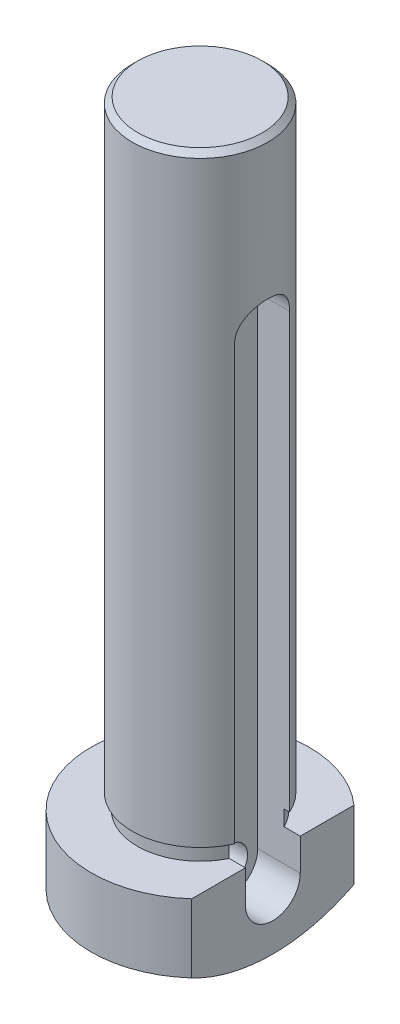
ISO-10303-21;
HEADER;
FILE_DESCRIPTION(('STEP AP214'),'2;1');
FILE_NAME('part.step','',(''),(''),'','','');
FILE_SCHEMA(('AUTOMOTIVE_DESIGN { 1 0 10303 214 1 1 1 1 }'));
ENDSEC;
DATA;
#1=APPLICATION_CONTEXT('core data for automotive mechanical design processes');
#2=APPLICATION_PROTOCOL_DEFINITION('international standard','automotive_design',2000,#1);
#3=PRODUCT_CONTEXT('',#1,'mechanical');
#4=PRODUCT('Part','Part','',(#3));
#5=PRODUCT_RELATED_PRODUCT_CATEGORY('part','',(#4));
#6=PRODUCT_DEFINITION_FORMATION('','',#4);
#7=PRODUCT_DEFINITION_CONTEXT('part definition',#1,'design');
#8=PRODUCT_DEFINITION('design','',#6,#7);
#9=PRODUCT_DEFINITION_SHAPE('','',#8);
#10=(LENGTH_UNIT() NAMED_UNIT(*) SI_UNIT(.MILLI.,.METRE.));
#11=(NAMED_UNIT(*) PLANE_ANGLE_UNIT() SI_UNIT($,.RADIAN.));
#12=(NAMED_UNIT(*) SI_UNIT($,.STERADIAN.) SOLID_ANGLE_UNIT());
#13=UNCERTAINTY_MEASURE_WITH_UNIT(LENGTH_MEASURE(1.E-05),#10,'distance_accuracy_value','');
#14=(GEOMETRIC_REPRESENTATION_CONTEXT(3) GLOBAL_UNCERTAINTY_ASSIGNED_CONTEXT((#13)) GLOBAL_UNIT_ASSIGNED_CONTEXT((#10,
#11,#12)) REPRESENTATION_CONTEXT('',''));
#15=CARTESIAN_POINT('',(0.,0.,0.));
#16=DIRECTION('',(0.,0.,1.));
#17=DIRECTION('',(1.,0.,0.));
#18=AXIS2_PLACEMENT_3D('',#15,#16,#17);
#19=CARTESIAN_POINT('',(0.,0.,0.));
#20=DIRECTION('',(0.,1.,0.));
#21=DIRECTION('',(0.,0.,1.));
#22=AXIS2_PLACEMENT_3D('',#19,#20,#21);
#23=CYLINDRICAL_SURFACE('',#22,5.0419);
#24=CARTESIAN_POINT('',(0.,1.5875,0.));
#25=DIRECTION('',(0.,1.,0.));
#26=DIRECTION('',(0.,0.,1.));
#27=AXIS2_PLACEMENT_3D('',#24,#25,#26);
#28=CIRCLE('',#27,5.0419);
#29=CARTESIAN_POINT('',(3.3655,1.5875,-3.75421967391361));
#30=VERTEX_POINT('',#29);
#31=CARTESIAN_POINT('',(3.3655,1.5875,3.75421967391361));
#32=VERTEX_POINT('',#31);
#33=EDGE_CURVE('E163',#30,#32,#28,.T.);
#34=ORIENTED_EDGE('',*,*,#33,.T.);
#35=DIRECTION('',(0.,1.,0.));
#36=VECTOR('',#35,1.);
#37=CARTESIAN_POINT('',(3.3655,0.,3.75421967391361));
#38=LINE('',#37,#36);
#39=CARTESIAN_POINT('',(3.3655,4.7625,3.75421967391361));
#40=VERTEX_POINT('',#39);
#41=EDGE_CURVE('E233',#32,#40,#38,.T.);
#42=ORIENTED_EDGE('',*,*,#41,.T.);
#43=CARTESIAN_POINT('',(0.,4.7625,0.));
#44=DIRECTION('',(0.,1.,0.));
#45=DIRECTION('',(0.,0.,1.));
#46=AXIS2_PLACEMENT_3D('',#43,#44,#45);
#47=CIRCLE('',#46,5.0419);
#48=CARTESIAN_POINT('',(3.3655,4.7625,-3.75421967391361));
#49=VERTEX_POINT('',#48);
#50=EDGE_CURVE('E160',#49,#40,#47,.T.);
#51=ORIENTED_EDGE('',*,*,#50,.F.);
#52=DIRECTION('',(0.,1.,0.));
#53=VECTOR('',#52,1.);
#54=CARTESIAN_POINT('',(3.3655,0.,-3.75421967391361));
#55=LINE('',#54,#53);
#56=EDGE_CURVE('E247',#49,#30,#55,.F.);
#57=ORIENTED_EDGE('',*,*,#56,.T.);
#58=EDGE_LOOP('',(#34,#42,#51,#57));
#59=FACE_BOUND('',#58,.T.);
#60=ADVANCED_FACE('F35',(#59),#23,.T.);
#61=CARTESIAN_POINT('',(5.0419,4.7625,0.));
#62=DIRECTION('',(0.,-1.,0.));
#63=DIRECTION('',(0.,0.,-1.));
#64=AXIS2_PLACEMENT_3D('',#61,#62,#63);
#65=PLANE('',#64);
#66=ORIENTED_EDGE('',*,*,#50,.T.);
#67=DIRECTION('',(0.,0.,-1.));
#68=VECTOR('',#67,1.);
#69=CARTESIAN_POINT('',(3.3655,4.7625,0.));
#70=LINE('',#69,#68);
#71=CARTESIAN_POINT('',(3.3655,4.7625,1.27));
#72=VERTEX_POINT('',#71);
#73=EDGE_CURVE('E238',#40,#72,#70,.T.);
#74=ORIENTED_EDGE('',*,*,#73,.T.);
#75=DIRECTION('',(1.,0.,0.));
#76=VECTOR('',#75,1.);
#77=CARTESIAN_POINT('',(5.0419,4.7625,1.27));
#78=LINE('',#77,#76);
#79=CARTESIAN_POINT('',(2.6163541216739,4.7625,1.27));
#80=VERTEX_POINT('',#79);
#81=EDGE_CURVE('E148',#80,#72,#78,.T.);
#82=ORIENTED_EDGE('',*,*,#81,.F.);
#83=CARTESIAN_POINT('',(0.,4.7625,0.));
#84=DIRECTION('',(0.,1.,0.));
#85=DIRECTION('',(0.,0.,1.));
#86=AXIS2_PLACEMENT_3D('',#83,#84,#85);
#87=CIRCLE('',#86,2.9083);
#88=CARTESIAN_POINT('',(2.6163541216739,4.7625,-1.27));
#89=VERTEX_POINT('',#88);
#90=EDGE_CURVE('E157',#89,#80,#87,.T.);
#91=ORIENTED_EDGE('',*,*,#90,.F.);
#92=DIRECTION('',(-1.,0.,0.));
#93=VECTOR('',#92,1.);
#94=CARTESIAN_POINT('',(5.0419,4.7625,-1.27));
#95=LINE('',#94,#93);
#96=CARTESIAN_POINT('',(3.3655,4.7625,-1.27));
#97=VERTEX_POINT('',#96);
#98=EDGE_CURVE('E142',#97,#89,#95,.T.);
#99=ORIENTED_EDGE('',*,*,#98,.F.);
#100=EDGE_CURVE('E50',#97,#49,#70,.T.);
#101=ORIENTED_EDGE('',*,*,#100,.T.);
#102=EDGE_LOOP('',(#66,#74,#82,#91,#99,#101));
#103=FACE_BOUND('',#102,.T.);
#104=ADVANCED_FACE('F197',(#103),#65,.F.);
#105=CARTESIAN_POINT('',(0.,0.,0.));
#106=DIRECTION('',(0.,1.,0.));
#107=DIRECTION('',(0.,0.,1.));
#108=AXIS2_PLACEMENT_3D('',#105,#106,#107);
#109=CYLINDRICAL_SURFACE('',#108,2.9083);
#110=DIRECTION('',(0.,1.,0.));
#111=VECTOR('',#110,1.);
#112=CARTESIAN_POINT('',(2.6163541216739,0.,1.27));
#113=LINE('',#112,#111);
#114=CARTESIAN_POINT('',(2.6163541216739,5.4737,1.27));
#115=VERTEX_POINT('',#114);
#116=EDGE_CURVE('E146',#115,#80,#113,.F.);
#117=ORIENTED_EDGE('',*,*,#116,.F.);
#118=CARTESIAN_POINT('',(0.,5.4737,0.));
#119=DIRECTION('',(0.,1.,0.));
#120=DIRECTION('',(0.,0.,1.));
#121=AXIS2_PLACEMENT_3D('',#118,#119,#120);
#122=CIRCLE('',#121,2.9083);
#123=CARTESIAN_POINT('',(2.6163541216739,5.4737,-1.27));
#124=VERTEX_POINT('',#123);
#125=EDGE_CURVE('E154',#124,#115,#122,.T.);
#126=ORIENTED_EDGE('',*,*,#125,.F.);
#127=DIRECTION('',(0.,1.,0.));
#128=VECTOR('',#127,1.);
#129=CARTESIAN_POINT('',(2.6163541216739,0.,-1.27));
#130=LINE('',#129,#128);
#131=EDGE_CURVE('E140',#89,#124,#130,.T.);
#132=ORIENTED_EDGE('',*,*,#131,.F.);
#133=ORIENTED_EDGE('',*,*,#90,.T.);
#134=EDGE_LOOP('',(#117,#126,#132,#133));
#135=FACE_BOUND('',#134,.T.);
#136=ADVANCED_FACE('F203',(#135),#109,.T.);
#137=CARTESIAN_POINT('',(2.9083,5.4737,0.));
#138=DIRECTION('',(0.,1.,0.));
#139=DIRECTION('',(0.,0.,1.));
#140=AXIS2_PLACEMENT_3D('',#137,#138,#139);
#141=PLANE('',#140);
#142=DIRECTION('',(-1.,0.,0.));
#143=VECTOR('',#142,1.);
#144=CARTESIAN_POINT('',(2.9083,5.4737,1.27));
#145=LINE('',#144,#143);
#146=CARTESIAN_POINT('',(2.86831686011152,5.4737,1.27));
#147=VERTEX_POINT('',#146);
#148=EDGE_CURVE('E144',#147,#115,#145,.T.);
#149=ORIENTED_EDGE('',*,*,#148,.F.);
#150=CARTESIAN_POINT('',(0.,5.4737,0.));
#151=DIRECTION('',(0.,1.,0.));
#152=DIRECTION('',(0.,0.,1.));
#153=AXIS2_PLACEMENT_3D('',#150,#151,#152);
#154=CIRCLE('',#153,3.1369);
#155=CARTESIAN_POINT('',(2.86831686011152,5.4737,-1.27));
#156=VERTEX_POINT('',#155);
#157=EDGE_CURVE('E151',#156,#147,#154,.T.);
#158=ORIENTED_EDGE('',*,*,#157,.F.);
#159=DIRECTION('',(1.,0.,0.));
#160=VECTOR('',#159,1.);
#161=CARTESIAN_POINT('',(2.9083,5.4737,-1.27));
#162=LINE('',#161,#160);
#163=EDGE_CURVE('E58',#124,#156,#162,.T.);
#164=ORIENTED_EDGE('',*,*,#163,.F.);
#165=ORIENTED_EDGE('',*,*,#125,.T.);
#166=EDGE_LOOP('',(#149,#158,#164,#165));
#167=FACE_BOUND('',#166,.T.);
#168=ADVANCED_FACE('F208',(#167),#141,.F.);
#169=CARTESIAN_POINT('',(0.,0.,0.));
#170=DIRECTION('',(0.,1.,0.));
#171=DIRECTION('',(0.,0.,1.));
#172=AXIS2_PLACEMENT_3D('',#169,#170,#171);
#173=CYLINDRICAL_SURFACE('',#172,3.1369);
#174=CARTESIAN_POINT('',(0.,33.0962,0.));
#175=DIRECTION('',(0.,-1.,0.));
#176=DIRECTION('',(0.,0.,-1.));
#177=AXIS2_PLACEMENT_3D('',#174,#175,#176);
#178=CIRCLE('',#177,3.1369);
#179=CARTESIAN_POINT('',(0.,33.0962,-3.1369));
#180=VERTEX_POINT('',#179);
#181=EDGE_CURVE('E11',#180,#180,#178,.T.);
#182=ORIENTED_EDGE('',*,*,#181,.T.);
#183=EDGE_LOOP('',(#182));
#184=FACE_BOUND('',#183,.T.);
#185=CARTESIAN_POINT('',(-3.03314714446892,25.5524,-0.800099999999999));
#186=CARTESIAN_POINT('',(-3.03314796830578,25.5965503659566,-0.800098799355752));
#187=CARTESIAN_POINT('',(-3.03412165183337,25.640713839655,-0.796433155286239));
#188=CARTESIAN_POINT('',(-3.03790072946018,25.7277704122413,-0.78189211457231));
#189=CARTESIAN_POINT('',(-3.04070714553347,25.7706627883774,-0.771012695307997));
#190=CARTESIAN_POINT('',(-3.04781363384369,25.8539053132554,-0.742420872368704));
#191=CARTESIAN_POINT('',(-3.05211172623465,25.8942587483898,-0.724717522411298));
#192=CARTESIAN_POINT('',(-3.06171479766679,25.9714278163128,-0.683008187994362));
#193=CARTESIAN_POINT('',(-3.06701983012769,26.0082432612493,-0.659001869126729));
#194=CARTESIAN_POINT('',(-3.07817506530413,26.078134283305,-0.604780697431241));
#195=CARTESIAN_POINT('',(-3.08403426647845,26.1111168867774,-0.574447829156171));
#196=CARTESIAN_POINT('',(-3.09555971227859,26.1715860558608,-0.508688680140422));
#197=CARTESIAN_POINT('',(-3.10122593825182,26.1990720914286,-0.473261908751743));
#198=CARTESIAN_POINT('',(-3.11182681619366,26.248150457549,-0.397681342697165));
#199=CARTESIAN_POINT('',(-3.11674961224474,26.2696511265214,-0.357466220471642));
#200=CARTESIAN_POINT('',(-3.12520613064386,26.3055519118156,-0.273845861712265));
#201=CARTESIAN_POINT('',(-3.12874006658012,26.3199531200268,-0.230441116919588));
#202=CARTESIAN_POINT('',(-3.1339570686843,26.3409474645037,-0.142643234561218));
#203=CARTESIAN_POINT('',(-3.13567752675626,26.347698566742,-0.0982901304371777));
#204=CARTESIAN_POINT('',(-3.13720415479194,26.3536972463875,-0.00904974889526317));
#205=CARTESIAN_POINT('',(-3.13701061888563,26.3529459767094,0.0358374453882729));
#206=CARTESIAN_POINT('',(-3.13475876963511,26.3440741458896,0.123775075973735));
#207=CARTESIAN_POINT('',(-3.13274361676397,26.336124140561,0.166843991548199));
#208=CARTESIAN_POINT('',(-3.12712541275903,26.3133550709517,0.251015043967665));
#209=CARTESIAN_POINT('',(-3.12352227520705,26.298535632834,0.292117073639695));
#210=CARTESIAN_POINT('',(-3.11506752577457,26.262312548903,0.371632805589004));
#211=CARTESIAN_POINT('',(-3.11020460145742,26.2408488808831,0.410017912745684));
#212=CARTESIAN_POINT('',(-3.09975673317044,26.1919922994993,0.482700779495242));
#213=CARTESIAN_POINT('',(-3.09417165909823,26.1645983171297,0.516997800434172));
#214=CARTESIAN_POINT('',(-3.08270162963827,26.1037470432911,0.581548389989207));
#215=CARTESIAN_POINT('',(-3.07681265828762,26.0701407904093,0.611660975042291));
#216=CARTESIAN_POINT('',(-3.06554180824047,25.9982939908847,0.665855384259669));
#217=CARTESIAN_POINT('',(-3.06015995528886,25.9600532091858,0.689936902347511));
#218=CARTESIAN_POINT('',(-3.05049778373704,25.8797376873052,0.731480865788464));
#219=CARTESIAN_POINT('',(-3.04622336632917,25.8376439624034,0.748908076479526));
#220=CARTESIAN_POINT('',(-3.03933497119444,25.7509885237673,0.776393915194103));
#221=CARTESIAN_POINT('',(-3.03672062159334,25.7064273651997,0.786454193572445));
#222=CARTESIAN_POINT('',(-3.03352677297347,25.6174127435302,0.798683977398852));
#223=CARTESIAN_POINT('',(-3.03289339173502,25.5729898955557,0.801062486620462));
#224=CARTESIAN_POINT('',(-3.03358630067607,25.4843817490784,0.798434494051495));
#225=CARTESIAN_POINT('',(-3.03491240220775,25.4401964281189,0.793428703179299));
#226=CARTESIAN_POINT('',(-3.03932310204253,25.3541023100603,0.776357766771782));
#227=CARTESIAN_POINT('',(-3.04237707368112,25.3121674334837,0.764415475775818));
#228=CARTESIAN_POINT('',(-3.0498700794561,25.2308951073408,0.733947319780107));
#229=CARTESIAN_POINT('',(-3.05430928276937,25.1915579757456,0.715420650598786));
#230=CARTESIAN_POINT('',(-3.06418516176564,25.1157155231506,0.67187610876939));
#231=CARTESIAN_POINT('',(-3.06964027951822,25.0792840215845,0.646733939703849));
#232=CARTESIAN_POINT('',(-3.08088864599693,25.0110803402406,0.590828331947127));
#233=CARTESIAN_POINT('',(-3.0866819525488,24.9793089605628,0.560063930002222));
#234=CARTESIAN_POINT('',(-3.09813740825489,24.9204745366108,0.492825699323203));
#235=CARTESIAN_POINT('',(-3.10379216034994,24.8935564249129,0.456223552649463));
#236=CARTESIAN_POINT('',(-3.11417687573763,24.8462481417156,0.378897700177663));
#237=CARTESIAN_POINT('',(-3.11890688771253,24.8258576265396,0.338174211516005));
#238=CARTESIAN_POINT('',(-3.12687908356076,24.7923637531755,0.254045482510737));
#239=CARTESIAN_POINT('',(-3.13013208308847,24.7792072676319,0.210662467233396));
#240=CARTESIAN_POINT('',(-3.13483115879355,24.7603968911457,0.122206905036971));
#241=CARTESIAN_POINT('',(-3.13627759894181,24.7547414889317,0.0771347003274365));
#242=CARTESIAN_POINT('',(-3.13718502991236,24.7511817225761,-0.0120605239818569));
#243=CARTESIAN_POINT('',(-3.13670070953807,24.7530638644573,-0.0561745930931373));
#244=CARTESIAN_POINT('',(-3.13392302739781,24.7640347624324,-0.143436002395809));
#245=CARTESIAN_POINT('',(-3.13162972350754,24.7731232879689,-0.186583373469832));
#246=CARTESIAN_POINT('',(-3.12550093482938,24.7981325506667,-0.270453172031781));
#247=CARTESIAN_POINT('',(-3.12167449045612,24.8140132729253,-0.311188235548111));
#248=CARTESIAN_POINT('',(-3.11288148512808,24.8521200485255,-0.389438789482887));
#249=CARTESIAN_POINT('',(-3.10791477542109,24.8743469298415,-0.426953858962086));
#250=CARTESIAN_POINT('',(-3.09722183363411,24.9251583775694,-0.498706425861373));
#251=CARTESIAN_POINT('',(-3.09147983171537,24.9538868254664,-0.532839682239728));
#252=CARTESIAN_POINT('',(-3.07995221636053,25.0166084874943,-0.595873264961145));
#253=CARTESIAN_POINT('',(-3.07416659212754,25.0506030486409,-0.624772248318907));
#254=CARTESIAN_POINT('',(-3.0630770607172,25.1236951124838,-0.677075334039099));
#255=CARTESIAN_POINT('',(-3.05778483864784,25.162879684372,-0.700360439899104));
#256=CARTESIAN_POINT('',(-3.04844075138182,25.2447370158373,-0.739978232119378));
#257=CARTESIAN_POINT('',(-3.04438801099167,25.2874072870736,-0.756315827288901));
#258=CARTESIAN_POINT('',(-3.03859433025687,25.3670491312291,-0.779229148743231));
#259=CARTESIAN_POINT('',(-3.03656734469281,25.4036498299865,-0.787038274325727));
#260=CARTESIAN_POINT('',(-3.0338434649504,25.4776306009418,-0.797473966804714));
#261=CARTESIAN_POINT('',(-3.03314644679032,25.5150106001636,-0.800101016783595));
#262=CARTESIAN_POINT('',(-3.03314714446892,25.5524,-0.800099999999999));
#263=B_SPLINE_CURVE_WITH_KNOTS('',3,(#185,#186,#187,#188,#189,#190,#191,#192,#193,#194,#195,
#196,#197,#198,#199,#200,#201,#202,#203,#204,#205,#206,#207,#208,#209,#210,#211,#212,#213,#214,
#215,#216,#217,#218,#219,#220,#221,#222,#223,#224,#225,#226,#227,#228,#229,#230,#231,#232,#233,
#234,#235,#236,#237,#238,#239,#240,#241,#242,#243,#244,#245,#246,#247,#248,#249,#250,#251,#252,
#253,#254,#255,#256,#257,#258,#259,#260,#261,#262),.UNSPECIFIED.,.T.,.F.,(4,2,2,2,2,2,2,2,2,2,2,
2,2,2,2,2,2,2,2,2,2,2,2,2,2,2,2,2,2,2,2,2,2,2,2,2,2,2,4),(0.,0.132313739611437,
0.264701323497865,0.396913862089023,0.529133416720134,0.664084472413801,0.799048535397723,
0.935978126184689,1.07288665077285,1.20691349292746,1.34091973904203,1.47183181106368,
1.60275100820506,1.73488922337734,1.86705127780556,2.00293331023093,2.13882223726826,
2.27542103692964,2.41198922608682,2.54480894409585,2.67761587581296,2.80813939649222,
2.93867886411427,3.07187191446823,3.20508780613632,3.34178904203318,3.47848307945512,
3.6141593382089,3.7498082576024,3.88164260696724,4.0134727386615,4.14453669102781,
4.27561775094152,4.40994666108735,4.5443099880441,4.68131078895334,4.81821462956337,
4.93027695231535,5.04232882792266),.UNSPECIFIED.);
#264=CARTESIAN_POINT('',(-3.03314714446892,25.5524,-0.800099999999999));
#265=VERTEX_POINT('',#264);
#266=EDGE_CURVE('E260',#265,#265,#263,.T.);
#267=ORIENTED_EDGE('',*,*,#266,.T.);
#268=EDGE_LOOP('',(#267));
#269=FACE_BOUND('',#268,.T.);
#270=DIRECTION('',(0.,1.,0.));
#271=VECTOR('',#270,1.);
#272=CARTESIAN_POINT('',(2.86831686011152,0.,1.27));
#273=LINE('',#272,#271);
#274=CARTESIAN_POINT('',(2.86831686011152,25.5524,1.27));
#275=VERTEX_POINT('',#274);
#276=EDGE_CURVE('E116',#275,#147,#273,.F.);
#277=ORIENTED_EDGE('',*,*,#276,.F.);
#278=CARTESIAN_POINT('',(2.86831686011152,25.5524,-1.27));
#279=CARTESIAN_POINT('',(2.86831228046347,25.5865372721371,-1.27000152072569));
#280=CARTESIAN_POINT('',(2.86892705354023,25.6206564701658,-1.26862270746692));
#281=CARTESIAN_POINT('',(2.87134964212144,25.6886187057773,-1.26313358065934));
#282=CARTESIAN_POINT('',(2.87315699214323,25.7224618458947,-1.25902433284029));
#283=CARTESIAN_POINT('',(2.88027699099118,25.822929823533,-1.24269627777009));
#284=CARTESIAN_POINT('',(2.88728848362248,25.8888304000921,-1.22647648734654));
#285=CARTESIAN_POINT('',(2.90495322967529,26.0166552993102,-1.1840218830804));
#286=CARTESIAN_POINT('',(2.91560254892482,26.0785838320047,-1.15779788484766));
#287=CARTESIAN_POINT('',(2.93933152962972,26.1972356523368,-1.09615716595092));
#288=CARTESIAN_POINT('',(2.95241356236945,26.2539537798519,-1.06073146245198));
#289=CARTESIAN_POINT('',(2.98037578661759,26.3638005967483,-0.979509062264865));
#290=CARTESIAN_POINT('',(2.99531437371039,26.4165833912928,-0.933264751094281));
#291=CARTESIAN_POINT('',(3.02482364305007,26.5138932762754,-0.832664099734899));
#292=CARTESIAN_POINT('',(3.03939424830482,26.5584186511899,-0.778306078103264));
#293=CARTESIAN_POINT('',(3.06723971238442,26.6397075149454,-0.660302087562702));
#294=CARTESIAN_POINT('',(3.08043785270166,26.676082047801,-0.596368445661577));
#295=CARTESIAN_POINT('',(3.10333328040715,26.7374100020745,-0.462659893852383));
#296=CARTESIAN_POINT('',(3.11303206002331,26.7623682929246,-0.392887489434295));
#297=CARTESIAN_POINT('',(3.12741857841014,26.7989044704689,-0.253142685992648));
#298=CARTESIAN_POINT('',(3.13233046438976,26.8110831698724,-0.183350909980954));
#299=CARTESIAN_POINT('',(3.13740114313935,26.8236512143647,-0.0425517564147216));
#300=CARTESIAN_POINT('',(3.13756166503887,26.8240448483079,0.0284551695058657));
#301=CARTESIAN_POINT('',(3.13324642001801,26.8133562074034,0.165317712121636));
#302=CARTESIAN_POINT('',(3.12903679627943,26.8029327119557,0.231234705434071));
#303=CARTESIAN_POINT('',(3.11681505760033,26.7720290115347,0.36028964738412));
#304=CARTESIAN_POINT('',(3.10880272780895,26.7515482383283,0.423427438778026));
#305=CARTESIAN_POINT('',(3.0896034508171,26.7008617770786,0.546277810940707));
#306=CARTESIAN_POINT('',(3.07837026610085,26.6705135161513,0.60592404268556));
#307=CARTESIAN_POINT('',(3.05383948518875,26.6010882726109,0.719432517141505));
#308=CARTESIAN_POINT('',(3.04054115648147,26.5620081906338,0.77329269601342));
#309=CARTESIAN_POINT('',(3.0121738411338,26.473180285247,0.877531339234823));
#310=CARTESIAN_POINT('',(2.99704591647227,26.4228932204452,0.927434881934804));
#311=CARTESIAN_POINT('',(2.96740404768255,26.3146029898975,1.01830484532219));
#312=CARTESIAN_POINT('',(2.95289039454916,26.2565962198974,1.05926706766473));
#313=CARTESIAN_POINT('',(2.92570847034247,26.1323226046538,1.13222635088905));
#314=CARTESIAN_POINT('',(2.91310878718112,26.0658598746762,1.16391690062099));
#315=CARTESIAN_POINT('',(2.89199846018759,25.9279304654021,1.21543096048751));
#316=CARTESIAN_POINT('',(2.883480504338,25.8564729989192,1.23527570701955));
#317=CARTESIAN_POINT('',(2.87456629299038,25.7456344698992,1.25581250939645));
#318=CARTESIAN_POINT('',(2.87223406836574,25.7072113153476,1.26112514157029));
#319=CARTESIAN_POINT('',(2.86910563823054,25.630000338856,1.26821960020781));
#320=CARTESIAN_POINT('',(2.86830859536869,25.5912127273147,1.27000335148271));
#321=CARTESIAN_POINT('',(2.86831686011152,25.5524,1.27));
#322=B_SPLINE_CURVE_WITH_KNOTS('',3,(#278,#279,#280,#281,#282,#283,#284,#285,#286,#287,#288,
#289,#290,#291,#292,#293,#294,#295,#296,#297,#298,#299,#300,#301,#302,#303,#304,#305,#306,#307,
#308,#309,#310,#311,#312,#313,#314,#315,#316,#317,#318,#319,#320,#321),.UNSPECIFIED.,.F.,.F.,(4,
2,2,2,2,2,2,2,2,2,2,2,2,2,2,2,2,2,2,2,2,4),(0.,0.102343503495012,0.204647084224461,
0.408256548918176,0.611646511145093,0.815235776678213,1.02953735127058,1.24388339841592,
1.46693998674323,1.68990134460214,1.90183353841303,2.11368860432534,2.31335799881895,
2.5130386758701,2.71574322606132,2.91851984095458,3.13487999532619,3.35134152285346,
3.57430997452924,3.7968774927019,3.91328211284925,4.02962322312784),.UNSPECIFIED.);
#323=CARTESIAN_POINT('',(2.86831686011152,25.5524,-1.27));
#324=VERTEX_POINT('',#323);
#325=EDGE_CURVE('E168',#324,#275,#322,.T.);
#326=ORIENTED_EDGE('',*,*,#325,.F.);
#327=DIRECTION('',(0.,1.,0.));
#328=VECTOR('',#327,1.);
#329=CARTESIAN_POINT('',(2.86831686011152,0.,-1.27));
#330=LINE('',#329,#328);
#331=EDGE_CURVE('E166',#156,#324,#330,.T.);
#332=ORIENTED_EDGE('',*,*,#331,.F.);
#333=ORIENTED_EDGE('',*,*,#157,.T.);
#334=EDGE_LOOP('',(#277,#326,#332,#333));
#335=FACE_BOUND('',#334,.T.);
#336=ADVANCED_FACE('F175',(#184,#269,#335),#173,.T.);
#337=CARTESIAN_POINT('',(0.,8.8002872,0.));
#338=DIRECTION('',(0.,1.,0.));
#339=DIRECTION('',(1.,0.,0.));
#340=AXIS2_PLACEMENT_3D('',#337,#338,#339);
#341=SPHERICAL_SURFACE('',#340,8.8002872);
#342=ORIENTED_EDGE('',*,*,#33,.F.);
#343=CARTESIAN_POINT('',(3.3655,8.8002872,0.));
#344=DIRECTION('',(-1.,0.,0.));
#345=DIRECTION('',(0.,0.,1.));
#346=AXIS2_PLACEMENT_3D('',#343,#344,#345);
#347=CIRCLE('',#346,8.13132612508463);
#348=EDGE_CURVE('E246',#30,#32,#347,.T.);
#349=ORIENTED_EDGE('',*,*,#348,.T.);
#350=EDGE_LOOP('',(#342,#349));
#351=FACE_BOUND('',#350,.T.);
#352=ADVANCED_FACE('F188',(#351),#341,.T.);
#353=CARTESIAN_POINT('',(3.1369,33.3502,0.));
#354=DIRECTION('',(0.,-1.,0.));
#355=DIRECTION('',(0.,0.,-1.));
#356=AXIS2_PLACEMENT_3D('',#353,#354,#355);
#357=PLANE('',#356);
#358=CARTESIAN_POINT('',(0.,33.3502,0.));
#359=DIRECTION('',(0.,-1.,0.));
#360=DIRECTION('',(0.,0.,-1.));
#361=AXIS2_PLACEMENT_3D('',#358,#359,#360);
#362=CIRCLE('',#361,2.8829);
#363=CARTESIAN_POINT('',(0.,33.3502,-2.8829));
#364=VERTEX_POINT('',#363);
#365=EDGE_CURVE('E43',#364,#364,#362,.F.);
#366=ORIENTED_EDGE('',*,*,#365,.T.);
#367=EDGE_LOOP('',(#366));
#368=FACE_BOUND('',#367,.T.);
#369=ADVANCED_FACE('F186',(#368),#357,.F.);
#370=CARTESIAN_POINT('',(6.477,3.2766,0.));
#371=DIRECTION('',(-1.,0.,0.));
#372=DIRECTION('',(0.,0.,1.));
#373=AXIS2_PLACEMENT_3D('',#370,#371,#372);
#374=CYLINDRICAL_SURFACE('',#373,1.27);
#375=CARTESIAN_POINT('',(3.3655,3.2766,0.));
#376=DIRECTION('',(-1.,0.,0.));
#377=DIRECTION('',(0.,0.,1.));
#378=AXIS2_PLACEMENT_3D('',#375,#376,#377);
#379=CIRCLE('',#378,1.27);
#380=CARTESIAN_POINT('',(3.3655,3.2766,-1.27));
#381=VERTEX_POINT('',#380);
#382=CARTESIAN_POINT('',(3.3655,3.2766,1.27));
#383=VERTEX_POINT('',#382);
#384=EDGE_CURVE('E112',#381,#383,#379,.T.);
#385=ORIENTED_EDGE('',*,*,#384,.F.);
#386=DIRECTION('',(-1.,0.,0.));
#387=VECTOR('',#386,1.);
#388=CARTESIAN_POINT('',(6.477,3.2766,-1.27));
#389=LINE('',#388,#387);
#390=CARTESIAN_POINT('',(1.397,3.2766,-1.27));
#391=VERTEX_POINT('',#390);
#392=EDGE_CURVE('E122',#381,#391,#389,.T.);
#393=ORIENTED_EDGE('',*,*,#392,.T.);
#394=CARTESIAN_POINT('',(1.397,3.2766,0.));
#395=DIRECTION('',(1.,0.,0.));
#396=DIRECTION('',(0.,0.,-1.));
#397=AXIS2_PLACEMENT_3D('',#394,#395,#396);
#398=CIRCLE('',#397,1.27);
#399=CARTESIAN_POINT('',(1.397,3.2766,1.27));
#400=VERTEX_POINT('',#399);
#401=EDGE_CURVE('E235',#400,#391,#398,.T.);
#402=ORIENTED_EDGE('',*,*,#401,.F.);
#403=DIRECTION('',(-1.,0.,0.));
#404=VECTOR('',#403,1.);
#405=CARTESIAN_POINT('',(6.477,3.2766,1.27));
#406=LINE('',#405,#404);
#407=EDGE_CURVE('E124',#383,#400,#406,.T.);
#408=ORIENTED_EDGE('',*,*,#407,.F.);
#409=EDGE_LOOP('',(#385,#393,#402,#408));
#410=FACE_BOUND('',#409,.T.);
#411=ADVANCED_FACE('F120',(#410),#374,.F.);
#412=CARTESIAN_POINT('',(6.477,25.5524,0.));
#413=DIRECTION('',(-1.,0.,0.));
#414=DIRECTION('',(0.,0.,1.));
#415=AXIS2_PLACEMENT_3D('',#412,#413,#414);
#416=CYLINDRICAL_SURFACE('',#415,1.27);
#417=ORIENTED_EDGE('',*,*,#325,.T.);
#418=DIRECTION('',(-1.,0.,0.));
#419=VECTOR('',#418,1.);
#420=CARTESIAN_POINT('',(6.477,25.5524,1.27));
#421=LINE('',#420,#419);
#422=CARTESIAN_POINT('',(1.397,25.5524,1.27));
#423=VERTEX_POINT('',#422);
#424=EDGE_CURVE('E133',#275,#423,#421,.T.);
#425=ORIENTED_EDGE('',*,*,#424,.T.);
#426=CARTESIAN_POINT('',(1.397,25.5524,0.));
#427=DIRECTION('',(1.,0.,0.));
#428=DIRECTION('',(0.,0.,-1.));
#429=AXIS2_PLACEMENT_3D('',#426,#427,#428);
#430=CIRCLE('',#429,1.27);
#431=CARTESIAN_POINT('',(1.397,25.5524,-1.27));
#432=VERTEX_POINT('',#431);
#433=EDGE_CURVE('E228',#432,#423,#430,.T.);
#434=ORIENTED_EDGE('',*,*,#433,.F.);
#435=DIRECTION('',(-1.,0.,0.));
#436=VECTOR('',#435,1.);
#437=CARTESIAN_POINT('',(6.477,25.5524,-1.27));
#438=LINE('',#437,#436);
#439=EDGE_CURVE('E131',#324,#432,#438,.T.);
#440=ORIENTED_EDGE('',*,*,#439,.F.);
#441=EDGE_LOOP('',(#417,#425,#434,#440));
#442=FACE_BOUND('',#441,.T.);
#443=ADVANCED_FACE('F179',(#442),#416,.F.);
#444=CARTESIAN_POINT('',(6.477,25.5524,1.27));
#445=DIRECTION('',(0.,0.,-1.));
#446=DIRECTION('',(0.,1.,0.));
#447=AXIS2_PLACEMENT_3D('',#444,#445,#446);
#448=PLANE('',#447);
#449=DIRECTION('',(0.,1.,0.));
#450=VECTOR('',#449,1.);
#451=CARTESIAN_POINT('',(3.3655,25.5524,1.27));
#452=LINE('',#451,#450);
#453=EDGE_CURVE('E243',#383,#72,#452,.T.);
#454=ORIENTED_EDGE('',*,*,#453,.F.);
#455=ORIENTED_EDGE('',*,*,#407,.T.);
#456=DIRECTION('',(0.,-1.,0.));
#457=VECTOR('',#456,1.);
#458=CARTESIAN_POINT('',(1.397,25.5524,1.27));
#459=LINE('',#458,#457);
#460=EDGE_CURVE('E232',#423,#400,#459,.T.);
#461=ORIENTED_EDGE('',*,*,#460,.F.);
#462=ORIENTED_EDGE('',*,*,#424,.F.);
#463=ORIENTED_EDGE('',*,*,#276,.T.);
#464=ORIENTED_EDGE('',*,*,#148,.T.);
#465=ORIENTED_EDGE('',*,*,#116,.T.);
#466=ORIENTED_EDGE('',*,*,#81,.T.);
#467=EDGE_LOOP('',(#454,#455,#461,#462,#463,#464,#465,#466));
#468=FACE_BOUND('',#467,.T.);
#469=ADVANCED_FACE('F183',(#468),#448,.T.);
#470=CARTESIAN_POINT('',(6.477,25.5524,-1.27));
#471=DIRECTION('',(0.,0.,1.));
#472=DIRECTION('',(0.,-1.,0.));
#473=AXIS2_PLACEMENT_3D('',#470,#471,#472);
#474=PLANE('',#473);
#475=DIRECTION('',(0.,-1.,0.));
#476=VECTOR('',#475,1.);
#477=CARTESIAN_POINT('',(3.3655,25.5524,-1.27));
#478=LINE('',#477,#476);
#479=EDGE_CURVE('E109',#97,#381,#478,.T.);
#480=ORIENTED_EDGE('',*,*,#479,.F.);
#481=ORIENTED_EDGE('',*,*,#98,.T.);
#482=ORIENTED_EDGE('',*,*,#131,.T.);
#483=ORIENTED_EDGE('',*,*,#163,.T.);
#484=ORIENTED_EDGE('',*,*,#331,.T.);
#485=ORIENTED_EDGE('',*,*,#439,.T.);
#486=DIRECTION('',(0.,1.,0.));
#487=VECTOR('',#486,1.);
#488=CARTESIAN_POINT('',(1.397,25.5524,-1.27));
#489=LINE('',#488,#487);
#490=EDGE_CURVE('E130',#391,#432,#489,.T.);
#491=ORIENTED_EDGE('',*,*,#490,.F.);
#492=ORIENTED_EDGE('',*,*,#392,.F.);
#493=EDGE_LOOP('',(#480,#481,#482,#483,#484,#485,#491,#492));
#494=FACE_BOUND('',#493,.T.);
#495=ADVANCED_FACE('F128',(#494),#474,.T.);
#496=CARTESIAN_POINT('',(1.397,25.5524,0.));
#497=DIRECTION('',(1.,0.,0.));
#498=DIRECTION('',(0.,0.,-1.));
#499=AXIS2_PLACEMENT_3D('',#496,#497,#498);
#500=PLANE('',#499);
#501=CARTESIAN_POINT('',(1.397,3.2766,0.));
#502=DIRECTION('',(1.,0.,0.));
#503=DIRECTION('',(0.,0.,-1.));
#504=AXIS2_PLACEMENT_3D('',#501,#502,#503);
#505=CIRCLE('',#504,0.8001);
#506=CARTESIAN_POINT('',(1.397,3.2766,-0.800100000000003));
#507=VERTEX_POINT('',#506);
#508=EDGE_CURVE('E257',#507,#507,#505,.T.);
#509=ORIENTED_EDGE('',*,*,#508,.F.);
#510=EDGE_LOOP('',(#509));
#511=FACE_BOUND('',#510,.T.);
#512=CARTESIAN_POINT('',(1.397,25.5524,0.));
#513=DIRECTION('',(1.,0.,0.));
#514=DIRECTION('',(0.,0.,-1.));
#515=AXIS2_PLACEMENT_3D('',#512,#513,#514);
#516=CIRCLE('',#515,0.8001);
#517=CARTESIAN_POINT('',(1.397,25.5524,-0.8001));
#518=VERTEX_POINT('',#517);
#519=EDGE_CURVE('E125',#518,#518,#516,.T.);
#520=ORIENTED_EDGE('',*,*,#519,.F.);
#521=EDGE_LOOP('',(#520));
#522=FACE_BOUND('',#521,.T.);
#523=ORIENTED_EDGE('',*,*,#433,.T.);
#524=ORIENTED_EDGE('',*,*,#460,.T.);
#525=ORIENTED_EDGE('',*,*,#401,.T.);
#526=ORIENTED_EDGE('',*,*,#490,.T.);
#527=EDGE_LOOP('',(#523,#524,#525,#526));
#528=FACE_BOUND('',#527,.T.);
#529=ADVANCED_FACE('F242',(#511,#522,#528),#500,.T.);
#530=CARTESIAN_POINT('',(3.3655,-4.74980000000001,-5.69010435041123));
#531=DIRECTION('',(-1.,0.,0.));
#532=DIRECTION('',(0.,0.,1.));
#533=AXIS2_PLACEMENT_3D('',#530,#531,#532);
#534=PLANE('',#533);
#535=ORIENTED_EDGE('',*,*,#348,.F.);
#536=ORIENTED_EDGE('',*,*,#56,.F.);
#537=ORIENTED_EDGE('',*,*,#100,.F.);
#538=ORIENTED_EDGE('',*,*,#479,.T.);
#539=ORIENTED_EDGE('',*,*,#384,.T.);
#540=ORIENTED_EDGE('',*,*,#453,.T.);
#541=ORIENTED_EDGE('',*,*,#73,.F.);
#542=ORIENTED_EDGE('',*,*,#41,.F.);
#543=EDGE_LOOP('',(#535,#536,#537,#538,#539,#540,#541,#542));
#544=FACE_BOUND('',#543,.T.);
#545=ADVANCED_FACE('F111',(#544),#534,.F.);
#546=CARTESIAN_POINT('',(0.0254000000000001,25.5524,0.));
#547=DIRECTION('',(1.,0.,0.));
#548=DIRECTION('',(0.,0.,-1.));
#549=AXIS2_PLACEMENT_3D('',#546,#547,#548);
#550=CYLINDRICAL_SURFACE('',#549,0.8001);
#551=ORIENTED_EDGE('',*,*,#519,.T.);
#552=EDGE_LOOP('',(#551));
#553=FACE_BOUND('',#552,.T.);
#554=ORIENTED_EDGE('',*,*,#266,.F.);
#555=EDGE_LOOP('',(#554));
#556=FACE_BOUND('',#555,.T.);
#557=ADVANCED_FACE('F269',(#553,#556),#550,.F.);
#558=CARTESIAN_POINT('',(0.0254000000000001,3.2766,0.));
#559=DIRECTION('',(1.,0.,0.));
#560=DIRECTION('',(0.,0.,-1.));
#561=AXIS2_PLACEMENT_3D('',#558,#559,#560);
#562=CYLINDRICAL_SURFACE('',#561,0.8001);
#563=CARTESIAN_POINT('',(0.0254000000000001,3.2766,0.));
#564=DIRECTION('',(1.,0.,0.));
#565=DIRECTION('',(0.,0.,-1.));
#566=AXIS2_PLACEMENT_3D('',#563,#564,#565);
#567=CIRCLE('',#566,0.8001);
#568=CARTESIAN_POINT('',(0.0254000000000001,3.2766,-0.800100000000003));
#569=VERTEX_POINT('',#568);
#570=EDGE_CURVE('E256',#569,#569,#567,.T.);
#571=ORIENTED_EDGE('',*,*,#570,.F.);
#572=EDGE_LOOP('',(#571));
#573=FACE_BOUND('',#572,.T.);
#574=ORIENTED_EDGE('',*,*,#508,.T.);
#575=EDGE_LOOP('',(#574));
#576=FACE_BOUND('',#575,.T.);
#577=ADVANCED_FACE('F266',(#573,#576),#562,.F.);
#578=CARTESIAN_POINT('',(0.0254000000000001,3.2766,0.));
#579=DIRECTION('',(1.,0.,0.));
#580=DIRECTION('',(0.,0.,-1.));
#581=AXIS2_PLACEMENT_3D('',#578,#579,#580);
#582=PLANE('',#581);
#583=ORIENTED_EDGE('',*,*,#570,.T.);
#584=EDGE_LOOP('',(#583));
#585=FACE_BOUND('',#584,.T.);
#586=ADVANCED_FACE('F264',(#585),#582,.T.);
#587=CARTESIAN_POINT('',(0.,33.3502,0.));
#588=DIRECTION('',(0.,-1.,0.));
#589=DIRECTION('',(0.,0.,-1.));
#590=AXIS2_PLACEMENT_3D('',#587,#588,#589);
#591=CONICAL_SURFACE('',#590,2.8829,0.785398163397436);
#592=ORIENTED_EDGE('',*,*,#181,.F.);
#593=EDGE_LOOP('',(#592));
#594=FACE_BOUND('',#593,.T.);
#595=ORIENTED_EDGE('',*,*,#365,.F.);
#596=EDGE_LOOP('',(#595));
#597=FACE_BOUND('',#596,.T.);
#598=ADVANCED_FACE('F37',(#594,#597),#591,.T.);
#599=CLOSED_SHELL('',(#60,#104,#136,#168,#336,#352,#369,#411,#443,#469,#495,#529,#545,#557,#577,
#586,#598));
#600=MANIFOLD_SOLID_BREP('B2',#599);
#601=ADVANCED_BREP_SHAPE_REPRESENTATION('',(#18,#600),#14);
#602=SHAPE_DEFINITION_REPRESENTATION(#9,#601);
ENDSEC;
END-ISO-10303-21;
